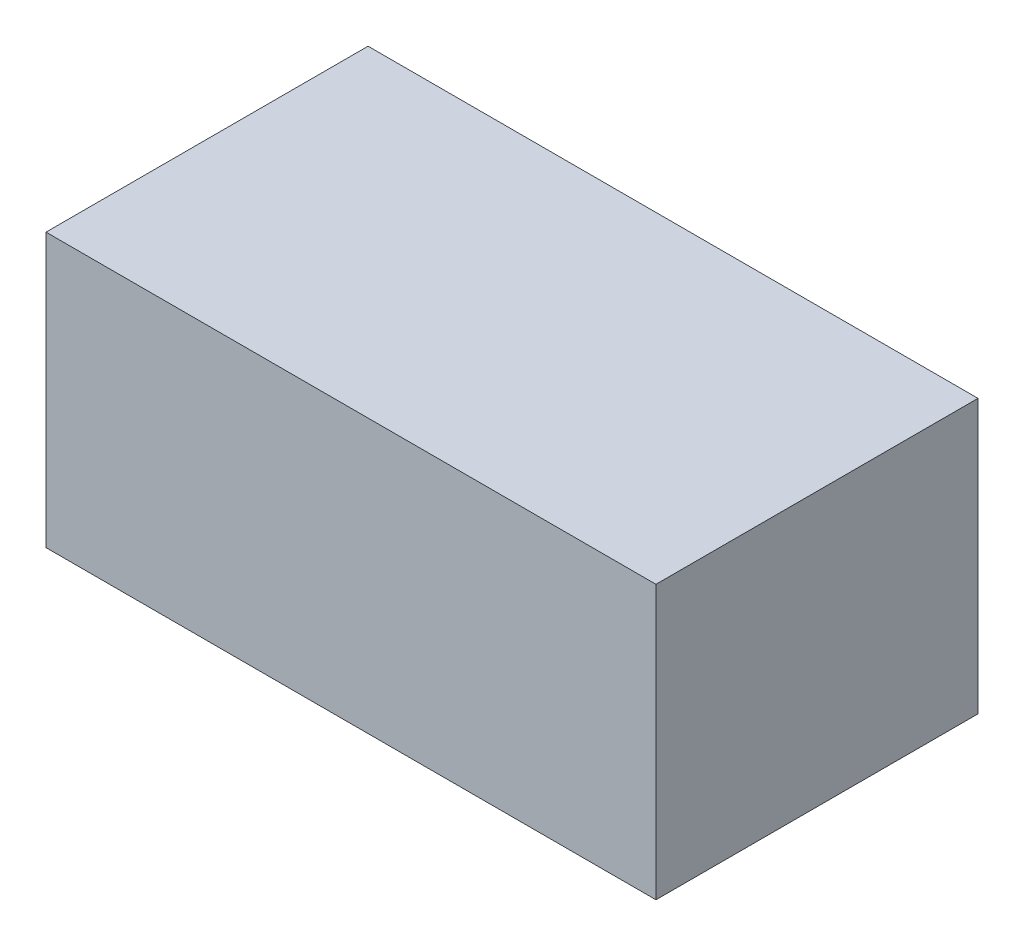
ISO-10303-21;
HEADER;
FILE_DESCRIPTION(('STEP AP214'),'2;1');
FILE_NAME('part.step','',(''),(''),'','','');
FILE_SCHEMA(('AUTOMOTIVE_DESIGN { 1 0 10303 214 1 1 1 1 }'));
ENDSEC;
DATA;
#1=APPLICATION_CONTEXT('core data for automotive mechanical design processes');
#2=APPLICATION_PROTOCOL_DEFINITION('international standard','automotive_design',2000,#1);
#3=PRODUCT_CONTEXT('',#1,'mechanical');
#4=PRODUCT('Part','Part','',(#3));
#5=PRODUCT_RELATED_PRODUCT_CATEGORY('part','',(#4));
#6=PRODUCT_DEFINITION_FORMATION('','',#4);
#7=PRODUCT_DEFINITION_CONTEXT('part definition',#1,'design');
#8=PRODUCT_DEFINITION('design','',#6,#7);
#9=PRODUCT_DEFINITION_SHAPE('','',#8);
#10=(LENGTH_UNIT() NAMED_UNIT(*) SI_UNIT(.MILLI.,.METRE.));
#11=(NAMED_UNIT(*) PLANE_ANGLE_UNIT() SI_UNIT($,.RADIAN.));
#12=(NAMED_UNIT(*) SI_UNIT($,.STERADIAN.) SOLID_ANGLE_UNIT());
#13=UNCERTAINTY_MEASURE_WITH_UNIT(LENGTH_MEASURE(1.E-05),#10,'distance_accuracy_value','');
#14=(GEOMETRIC_REPRESENTATION_CONTEXT(3) GLOBAL_UNCERTAINTY_ASSIGNED_CONTEXT((#13)) GLOBAL_UNIT_ASSIGNED_CONTEXT((#10,
#11,#12)) REPRESENTATION_CONTEXT('',''));
#15=CARTESIAN_POINT('',(0.,0.,0.));
#16=DIRECTION('',(0.,0.,1.));
#17=DIRECTION('',(1.,0.,0.));
#18=AXIS2_PLACEMENT_3D('',#15,#16,#17);
#19=CARTESIAN_POINT('',(0.,71.12,0.));
#20=DIRECTION('',(1.,0.,0.));
#21=DIRECTION('',(0.,0.,-1.));
#22=AXIS2_PLACEMENT_3D('',#19,#20,#21);
#23=PLANE('',#22);
#24=DIRECTION('',(0.,0.,1.));
#25=VECTOR('',#24,1.);
#26=CARTESIAN_POINT('',(0.,0.,0.));
#27=LINE('',#26,#25);
#28=CARTESIAN_POINT('',(0.,0.,-83.82));
#29=VERTEX_POINT('',#28);
#30=CARTESIAN_POINT('',(0.,0.,0.));
#31=VERTEX_POINT('',#30);
#32=EDGE_CURVE('E96',#29,#31,#27,.T.);
#33=ORIENTED_EDGE('',*,*,#32,.T.);
#34=DIRECTION('',(0.,-1.,0.));
#35=VECTOR('',#34,1.);
#36=CARTESIAN_POINT('',(0.,71.12,0.));
#37=LINE('',#36,#35);
#38=CARTESIAN_POINT('',(0.,71.12,0.));
#39=VERTEX_POINT('',#38);
#40=EDGE_CURVE('E11',#39,#31,#37,.T.);
#41=ORIENTED_EDGE('',*,*,#40,.F.);
#42=DIRECTION('',(0.,0.,1.));
#43=VECTOR('',#42,1.);
#44=CARTESIAN_POINT('',(0.,71.12,0.));
#45=LINE('',#44,#43);
#46=CARTESIAN_POINT('',(0.,71.12,-83.82));
#47=VERTEX_POINT('',#46);
#48=EDGE_CURVE('E84',#47,#39,#45,.T.);
#49=ORIENTED_EDGE('',*,*,#48,.F.);
#50=DIRECTION('',(0.,-1.,0.));
#51=VECTOR('',#50,1.);
#52=CARTESIAN_POINT('',(0.,71.12,-83.82));
#53=LINE('',#52,#51);
#54=EDGE_CURVE('E92',#47,#29,#53,.T.);
#55=ORIENTED_EDGE('',*,*,#54,.T.);
#56=EDGE_LOOP('',(#33,#41,#49,#55));
#57=FACE_BOUND('',#56,.T.);
#58=ADVANCED_FACE('F33',(#57),#23,.F.);
#59=CARTESIAN_POINT('',(0.,71.12,0.));
#60=DIRECTION('',(0.,0.,-1.));
#61=DIRECTION('',(-1.,0.,0.));
#62=AXIS2_PLACEMENT_3D('',#59,#60,#61);
#63=PLANE('',#62);
#64=DIRECTION('',(1.,0.,0.));
#65=VECTOR('',#64,1.);
#66=CARTESIAN_POINT('',(0.,0.,0.));
#67=LINE('',#66,#65);
#68=CARTESIAN_POINT('',(158.75,0.,0.));
#69=VERTEX_POINT('',#68);
#70=EDGE_CURVE('E88',#31,#69,#67,.T.);
#71=ORIENTED_EDGE('',*,*,#70,.T.);
#72=DIRECTION('',(0.,-1.,0.));
#73=VECTOR('',#72,1.);
#74=CARTESIAN_POINT('',(158.75,71.12,0.));
#75=LINE('',#74,#73);
#76=CARTESIAN_POINT('',(158.75,71.12,0.));
#77=VERTEX_POINT('',#76);
#78=EDGE_CURVE('E41',#77,#69,#75,.T.);
#79=ORIENTED_EDGE('',*,*,#78,.F.);
#80=DIRECTION('',(1.,0.,0.));
#81=VECTOR('',#80,1.);
#82=CARTESIAN_POINT('',(0.,71.12,0.));
#83=LINE('',#82,#81);
#84=EDGE_CURVE('E79',#39,#77,#83,.T.);
#85=ORIENTED_EDGE('',*,*,#84,.F.);
#86=ORIENTED_EDGE('',*,*,#40,.T.);
#87=EDGE_LOOP('',(#71,#79,#85,#86));
#88=FACE_BOUND('',#87,.T.);
#89=ADVANCED_FACE('F87',(#88),#63,.F.);
#90=CARTESIAN_POINT('',(158.75,71.12,0.));
#91=DIRECTION('',(-1.,0.,0.));
#92=DIRECTION('',(0.,0.,1.));
#93=AXIS2_PLACEMENT_3D('',#90,#91,#92);
#94=PLANE('',#93);
#95=DIRECTION('',(0.,0.,-1.));
#96=VECTOR('',#95,1.);
#97=CARTESIAN_POINT('',(158.75,0.,0.));
#98=LINE('',#97,#96);
#99=CARTESIAN_POINT('',(158.75,0.,-83.82));
#100=VERTEX_POINT('',#99);
#101=EDGE_CURVE('E66',#69,#100,#98,.T.);
#102=ORIENTED_EDGE('',*,*,#101,.T.);
#103=DIRECTION('',(0.,-1.,0.));
#104=VECTOR('',#103,1.);
#105=CARTESIAN_POINT('',(158.75,71.12,-83.82));
#106=LINE('',#105,#104);
#107=CARTESIAN_POINT('',(158.75,71.12,-83.82));
#108=VERTEX_POINT('',#107);
#109=EDGE_CURVE('E89',#108,#100,#106,.T.);
#110=ORIENTED_EDGE('',*,*,#109,.F.);
#111=DIRECTION('',(0.,0.,-1.));
#112=VECTOR('',#111,1.);
#113=CARTESIAN_POINT('',(158.75,71.12,0.));
#114=LINE('',#113,#112);
#115=EDGE_CURVE('E82',#77,#108,#114,.T.);
#116=ORIENTED_EDGE('',*,*,#115,.F.);
#117=ORIENTED_EDGE('',*,*,#78,.T.);
#118=EDGE_LOOP('',(#102,#110,#116,#117));
#119=FACE_BOUND('',#118,.T.);
#120=ADVANCED_FACE('F90',(#119),#94,.F.);
#121=CARTESIAN_POINT('',(0.,71.12,-83.82));
#122=DIRECTION('',(0.,0.,1.));
#123=DIRECTION('',(1.,0.,0.));
#124=AXIS2_PLACEMENT_3D('',#121,#122,#123);
#125=PLANE('',#124);
#126=DIRECTION('',(-1.,0.,0.));
#127=VECTOR('',#126,1.);
#128=CARTESIAN_POINT('',(0.,0.,-83.82));
#129=LINE('',#128,#127);
#130=EDGE_CURVE('E72',#100,#29,#129,.T.);
#131=ORIENTED_EDGE('',*,*,#130,.T.);
#132=ORIENTED_EDGE('',*,*,#54,.F.);
#133=DIRECTION('',(-1.,0.,0.));
#134=VECTOR('',#133,1.);
#135=CARTESIAN_POINT('',(0.,71.12,-83.82));
#136=LINE('',#135,#134);
#137=EDGE_CURVE('E49',#108,#47,#136,.T.);
#138=ORIENTED_EDGE('',*,*,#137,.F.);
#139=ORIENTED_EDGE('',*,*,#109,.T.);
#140=EDGE_LOOP('',(#131,#132,#138,#139));
#141=FACE_BOUND('',#140,.T.);
#142=ADVANCED_FACE('F103',(#141),#125,.F.);
#143=CARTESIAN_POINT('',(0.,71.12,0.));
#144=DIRECTION('',(0.,-1.,0.));
#145=DIRECTION('',(0.,0.,-1.));
#146=AXIS2_PLACEMENT_3D('',#143,#144,#145);
#147=PLANE('',#146);
#148=ORIENTED_EDGE('',*,*,#48,.T.);
#149=ORIENTED_EDGE('',*,*,#84,.T.);
#150=ORIENTED_EDGE('',*,*,#115,.T.);
#151=ORIENTED_EDGE('',*,*,#137,.T.);
#152=EDGE_LOOP('',(#148,#149,#150,#151));
#153=FACE_BOUND('',#152,.T.);
#154=ADVANCED_FACE('F80',(#153),#147,.F.);
#155=CARTESIAN_POINT('',(0.,0.,0.));
#156=DIRECTION('',(0.,-1.,0.));
#157=DIRECTION('',(0.,0.,-1.));
#158=AXIS2_PLACEMENT_3D('',#155,#156,#157);
#159=PLANE('',#158);
#160=ORIENTED_EDGE('',*,*,#32,.F.);
#161=ORIENTED_EDGE('',*,*,#130,.F.);
#162=ORIENTED_EDGE('',*,*,#101,.F.);
#163=ORIENTED_EDGE('',*,*,#70,.F.);
#164=EDGE_LOOP('',(#160,#161,#162,#163));
#165=FACE_BOUND('',#164,.T.);
#166=ADVANCED_FACE('F106',(#165),#159,.T.);
#167=CLOSED_SHELL('',(#58,#89,#120,#142,#154,#166));
#168=MANIFOLD_SOLID_BREP('B2',#167);
#169=ADVANCED_BREP_SHAPE_REPRESENTATION('',(#18,#168),#14);
#170=SHAPE_DEFINITION_REPRESENTATION(#9,#169);
ENDSEC;
END-ISO-10303-21;
